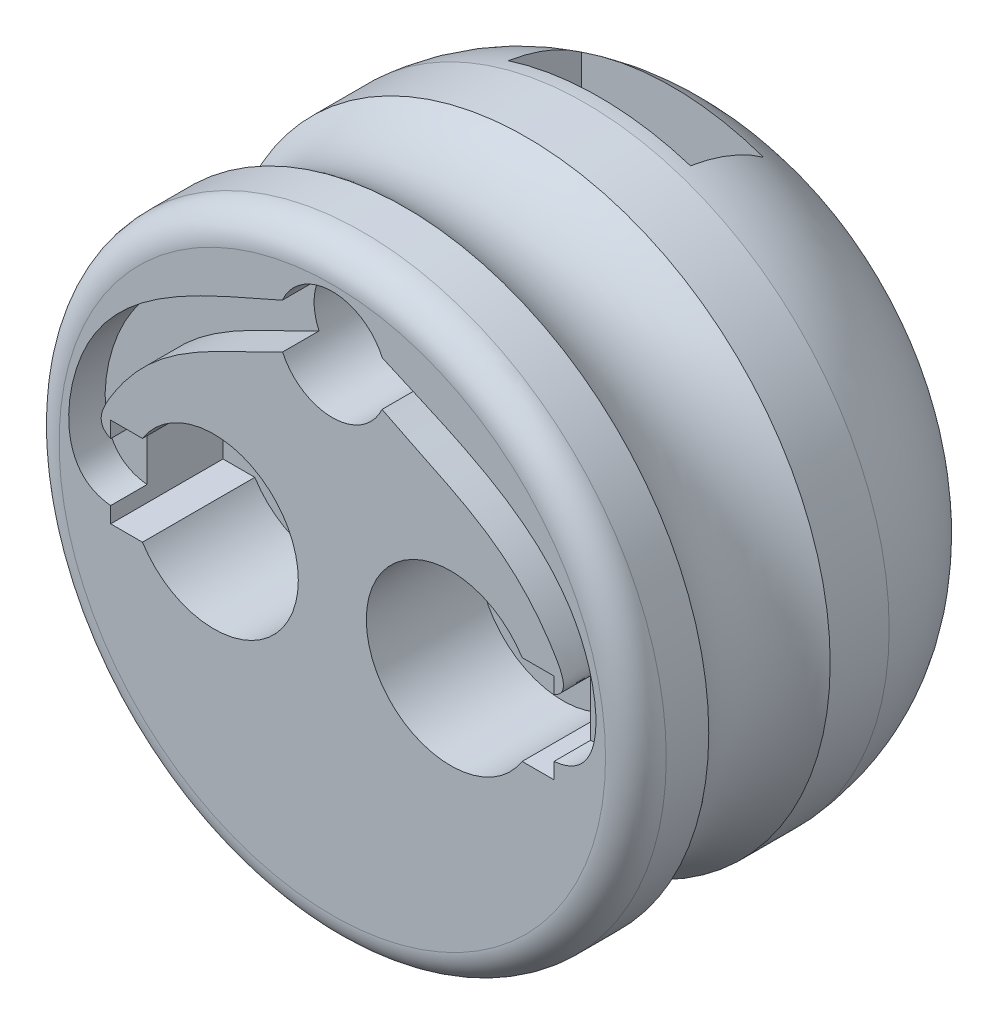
ISO-10303-21;
HEADER;
FILE_DESCRIPTION(('STEP AP214'),'2;1');
FILE_NAME('part.step','',(''),(''),'','','');
FILE_SCHEMA(('AUTOMOTIVE_DESIGN { 1 0 10303 214 1 1 1 1 }'));
ENDSEC;
DATA;
#1=APPLICATION_CONTEXT('core data for automotive mechanical design processes');
#2=APPLICATION_PROTOCOL_DEFINITION('international standard','automotive_design',2000,#1);
#3=PRODUCT_CONTEXT('',#1,'mechanical');
#4=PRODUCT('Part','Part','',(#3));
#5=PRODUCT_RELATED_PRODUCT_CATEGORY('part','',(#4));
#6=PRODUCT_DEFINITION_FORMATION('','',#4);
#7=PRODUCT_DEFINITION_CONTEXT('part definition',#1,'design');
#8=PRODUCT_DEFINITION('design','',#6,#7);
#9=PRODUCT_DEFINITION_SHAPE('','',#8);
#10=(LENGTH_UNIT() NAMED_UNIT(*) SI_UNIT(.MILLI.,.METRE.));
#11=(NAMED_UNIT(*) PLANE_ANGLE_UNIT() SI_UNIT($,.RADIAN.));
#12=(NAMED_UNIT(*) SI_UNIT($,.STERADIAN.) SOLID_ANGLE_UNIT());
#13=UNCERTAINTY_MEASURE_WITH_UNIT(LENGTH_MEASURE(1.E-05),#10,'distance_accuracy_value','');
#14=(GEOMETRIC_REPRESENTATION_CONTEXT(3) GLOBAL_UNCERTAINTY_ASSIGNED_CONTEXT((#13)) GLOBAL_UNIT_ASSIGNED_CONTEXT((#10,
#11,#12)) REPRESENTATION_CONTEXT('',''));
#15=CARTESIAN_POINT('',(0.,0.,0.));
#16=DIRECTION('',(0.,0.,1.));
#17=DIRECTION('',(1.,0.,0.));
#18=AXIS2_PLACEMENT_3D('',#15,#16,#17);
#19=CARTESIAN_POINT('',(0.,25.872394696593,0.));
#20=DIRECTION('',(0.,-1.,0.));
#21=DIRECTION('',(0.,0.,-1.));
#22=AXIS2_PLACEMENT_3D('',#19,#20,#21);
#23=PLANE('',#22);
#24=DIRECTION('',(1.,0.,0.));
#25=VECTOR('',#24,1.);
#26=CARTESIAN_POINT('',(15.,25.872394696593,21.));
#27=LINE('',#26,#25);
#28=CARTESIAN_POINT('',(-15.,25.872394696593,21.));
#29=VERTEX_POINT('',#28);
#30=CARTESIAN_POINT('',(-10.706035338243,25.872394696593,21.));
#31=VERTEX_POINT('',#30);
#32=EDGE_CURVE('E230',#29,#31,#27,.T.);
#33=ORIENTED_EDGE('',*,*,#32,.T.);
#34=DIRECTION('',(0.,0.,-1.));
#35=VECTOR('',#34,1.);
#36=CARTESIAN_POINT('',(-10.706035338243,25.872394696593,42.));
#37=LINE('',#36,#35);
#38=CARTESIAN_POINT('',(-10.706035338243,25.872394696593,9.));
#39=VERTEX_POINT('',#38);
#40=EDGE_CURVE('E571',#31,#39,#37,.T.);
#41=ORIENTED_EDGE('',*,*,#40,.T.);
#42=DIRECTION('',(-1.,0.,0.));
#43=VECTOR('',#42,1.);
#44=CARTESIAN_POINT('',(15.,25.872394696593,8.99999999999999));
#45=LINE('',#44,#43);
#46=CARTESIAN_POINT('',(-15.,25.872394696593,8.99999999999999));
#47=VERTEX_POINT('',#46);
#48=EDGE_CURVE('E219',#39,#47,#45,.T.);
#49=ORIENTED_EDGE('',*,*,#48,.T.);
#50=DIRECTION('',(0.,0.,1.));
#51=VECTOR('',#50,1.);
#52=CARTESIAN_POINT('',(-15.,25.872394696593,8.99999999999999));
#53=LINE('',#52,#51);
#54=EDGE_CURVE('E226',#47,#29,#53,.T.);
#55=ORIENTED_EDGE('',*,*,#54,.T.);
#56=EDGE_LOOP('',(#33,#41,#49,#55));
#57=FACE_BOUND('',#56,.T.);
#58=ADVANCED_FACE('F35',(#57),#23,.F.);
#59=CARTESIAN_POINT('',(-24.0127119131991,23.1615790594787,59.));
#60=DIRECTION('',(0.,0.,1.));
#61=DIRECTION('',(1.,0.,0.));
#62=AXIS2_PLACEMENT_3D('',#59,#60,#61);
#63=PLANE('',#62);
#64=CARTESIAN_POINT('',(0.,35.,59.));
#65=DIRECTION('',(0.,0.,1.));
#66=DIRECTION('',(1.,0.,0.));
#67=AXIS2_PLACEMENT_3D('',#64,#65,#66);
#68=CIRCLE('',#67,9.);
#69=CARTESIAN_POINT('',(-8.23470438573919,38.6317549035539,59.));
#70=VERTEX_POINT('',#69);
#71=CARTESIAN_POINT('',(-8.18910458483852,31.2665610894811,59.));
#72=VERTEX_POINT('',#71);
#73=EDGE_CURVE('E369',#70,#72,#68,.T.);
#74=ORIENTED_EDGE('',*,*,#73,.F.);
#75=CARTESIAN_POINT('',(-1.3419885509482,42.0337612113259,59.));
#76=CARTESIAN_POINT('',(-15.3143615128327,34.2568607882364,59.));
#77=CARTESIAN_POINT('',(-44.4025139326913,28.5990180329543,59.));
#78=CARTESIAN_POINT('',(-44.3308836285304,-4.04239458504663,59.));
#79=CARTESIAN_POINT('',(-36.5,-4.78672823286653,59.));
#80=B_SPLINE_CURVE_WITH_KNOTS('',3,(#75,#76,#77,#78,#79),.UNSPECIFIED.,.F.,.F.,(4,1,4),(0.,
0.72708494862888,1.),.UNSPECIFIED.);
#81=CARTESIAN_POINT('',(-36.5,-4.78672823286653,59.));
#82=VERTEX_POINT('',#81);
#83=EDGE_CURVE('E410',#70,#82,#80,.T.);
#84=ORIENTED_EDGE('',*,*,#83,.T.);
#85=DIRECTION('',(0.,1.,0.));
#86=VECTOR('',#85,1.);
#87=CARTESIAN_POINT('',(-36.5,4.75630146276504,59.));
#88=LINE('',#87,#86);
#89=CARTESIAN_POINT('',(-36.5,4.75630146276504,59.));
#90=VERTEX_POINT('',#89);
#91=EDGE_CURVE('E415',#82,#90,#88,.T.);
#92=ORIENTED_EDGE('',*,*,#91,.T.);
#93=CARTESIAN_POINT('',(-36.5,4.75630146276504,59.));
#94=CARTESIAN_POINT('',(-39.1824470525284,5.89615674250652,59.));
#95=CARTESIAN_POINT('',(-29.7396914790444,24.5928193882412,59.));
#96=CARTESIAN_POINT('',(-16.069951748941,26.0231191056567,59.));
#97=CARTESIAN_POINT('',(-2.08753774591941,34.727379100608,59.));
#98=B_SPLINE_CURVE_WITH_KNOTS('',3,(#93,#94,#95,#96,#97),.UNSPECIFIED.,.F.,.F.,(4,1,4),(0.,
0.137787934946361,1.),.UNSPECIFIED.);
#99=EDGE_CURVE('E265',#90,#72,#98,.T.);
#100=ORIENTED_EDGE('',*,*,#99,.T.);
#101=EDGE_LOOP('',(#74,#84,#92,#100));
#102=FACE_BOUND('',#101,.T.);
#103=ADVANCED_FACE('F404',(#102),#63,.T.);
#104=CARTESIAN_POINT('',(0.,0.,65.));
#105=DIRECTION('',(0.,0.,-1.));
#106=DIRECTION('',(-1.,0.,0.));
#107=AXIS2_PLACEMENT_3D('',#104,#105,#106);
#108=CYLINDRICAL_SURFACE('',#107,50.);
#109=CARTESIAN_POINT('',(0.,0.,33.));
#110=DIRECTION('',(0.,0.,1.));
#111=DIRECTION('',(1.,0.,0.));
#112=AXIS2_PLACEMENT_3D('',#109,#110,#111);
#113=CIRCLE('',#112,50.);
#114=CARTESIAN_POINT('',(50.,0.,33.));
#115=VERTEX_POINT('',#114);
#116=EDGE_CURVE('E492',#115,#115,#113,.T.);
#117=ORIENTED_EDGE('',*,*,#116,.F.);
#118=EDGE_LOOP('',(#117));
#119=FACE_BOUND('',#118,.T.);
#120=CARTESIAN_POINT('',(0.,0.,23.2866542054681));
#121=DIRECTION('',(0.,0.,1.));
#122=DIRECTION('',(1.,0.,0.));
#123=AXIS2_PLACEMENT_3D('',#120,#121,#122);
#124=CIRCLE('',#123,50.);
#125=CARTESIAN_POINT('',(50.,0.,23.2866542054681));
#126=VERTEX_POINT('',#125);
#127=EDGE_CURVE('E352',#126,#126,#124,.T.);
#128=ORIENTED_EDGE('',*,*,#127,.T.);
#129=EDGE_LOOP('',(#128));
#130=FACE_BOUND('',#129,.T.);
#131=ADVANCED_FACE('F340',(#119,#130),#108,.T.);
#132=CARTESIAN_POINT('',(0.,-35.7882564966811,0.));
#133=CARTESIAN_POINT('',(0.,-48.6758327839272,8.17835868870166));
#134=CARTESIAN_POINT('',(0.,-50.,23.2866542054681));
#135=B_SPLINE_CURVE_WITH_KNOTS('',2,(#132,#133,#134),.UNSPECIFIED.,.F.,.F.,(3,3),(0.,1.),.UNSPECIFIED.);
#136=CARTESIAN_POINT('',(0.,0.,65.));
#137=DIRECTION('',(0.,0.,1.));
#138=AXIS1_PLACEMENT('',#136,#137);
#139=SURFACE_OF_REVOLUTION('',#135,#138);
#140=CARTESIAN_POINT('',(0.,0.,8.99999999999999));
#141=DIRECTION('',(0.,0.,1.));
#142=DIRECTION('',(1.,0.,0.));
#143=AXIS2_PLACEMENT_3D('',#140,#141,#142);
#144=CIRCLE('',#143,45.2043558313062);
#145=CARTESIAN_POINT('',(-15.,42.6430977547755,8.99999999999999));
#146=VERTEX_POINT('',#145);
#147=CARTESIAN_POINT('',(15.,42.6430977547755,8.99999999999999));
#148=VERTEX_POINT('',#147);
#149=EDGE_CURVE('E236',#146,#148,#144,.F.);
#150=ORIENTED_EDGE('',*,*,#149,.T.);
#151=CARTESIAN_POINT('',(15.,42.6430977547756,9.00000000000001));
#152=CARTESIAN_POINT('',(15.,42.7988184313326,9.22080204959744));
#153=CARTESIAN_POINT('',(15.,42.9512231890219,9.44392347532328));
#154=CARTESIAN_POINT('',(15.,43.2492571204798,9.89464655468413));
#155=CARTESIAN_POINT('',(15.,43.3948862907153,10.1222482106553));
#156=CARTESIAN_POINT('',(15.,43.8212491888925,10.8113004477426));
#157=CARTESIAN_POINT('',(15.,44.0916178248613,11.2792244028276));
#158=CARTESIAN_POINT('',(15.,44.6036584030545,12.230418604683));
#159=CARTESIAN_POINT('',(15.,44.8453329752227,12.7136874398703));
#160=CARTESIAN_POINT('',(15.,45.2953929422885,13.6847733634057));
#161=CARTESIAN_POINT('',(15.,45.5043058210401,14.1723460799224));
#162=CARTESIAN_POINT('',(15.,45.8939603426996,15.1585552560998));
#163=CARTESIAN_POINT('',(15.,46.0747040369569,15.6571909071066));
#164=CARTESIAN_POINT('',(15.,46.408288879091,16.6634927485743));
#165=CARTESIAN_POINT('',(15.,46.5611412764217,17.1711552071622));
#166=CARTESIAN_POINT('',(15.,46.774489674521,17.9545247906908));
#167=CARTESIAN_POINT('',(15.,46.8447350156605,18.2276202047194));
#168=CARTESIAN_POINT('',(15.,46.9776521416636,18.7755892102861));
#169=CARTESIAN_POINT('',(15.,47.0403256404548,19.0504623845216));
#170=CARTESIAN_POINT('',(15.,47.1586531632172,19.6036336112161));
#171=CARTESIAN_POINT('',(15.,47.2142574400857,19.8819422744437));
#172=CARTESIAN_POINT('',(15.,47.3181302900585,20.439978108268));
#173=CARTESIAN_POINT('',(15.,47.3663975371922,20.7197055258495));
#174=CARTESIAN_POINT('',(15.,47.4110750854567,21.));
#175=B_SPLINE_CURVE_WITH_KNOTS('',3,(#151,#152,#153,#154,#155,#156,#157,#158,#159,#160,#161,
#162,#163,#164,#165,#166,#167,#168,#169,#170,#171,#172,#173,#174),.UNSPECIFIED.,.F.,.F.,(4,2,2,
2,2,2,2,2,2,2,2,4),(0.,0.810506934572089,1.62101429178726,3.24120023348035,4.86123756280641,
6.45167947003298,8.0420055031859,9.63168868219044,10.4775534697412,11.3232264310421,
12.1745549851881,13.0260372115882),.UNSPECIFIED.);
#176=CARTESIAN_POINT('',(15.,47.4110750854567,21.));
#177=VERTEX_POINT('',#176);
#178=EDGE_CURVE('E377',#148,#177,#175,.T.);
#179=ORIENTED_EDGE('',*,*,#178,.T.);
#180=CARTESIAN_POINT('',(0.,0.,21.));
#181=DIRECTION('',(0.,0.,1.));
#182=DIRECTION('',(1.,0.,0.));
#183=AXIS2_PLACEMENT_3D('',#180,#181,#182);
#184=CIRCLE('',#183,49.727357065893);
#185=CARTESIAN_POINT('',(-15.,47.4110750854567,21.));
#186=VERTEX_POINT('',#185);
#187=EDGE_CURVE('E246',#177,#186,#184,.T.);
#188=ORIENTED_EDGE('',*,*,#187,.T.);
#189=CARTESIAN_POINT('',(-15.,47.4110750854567,21.));
#190=CARTESIAN_POINT('',(-15.,47.3261223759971,20.4668540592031));
#191=CARTESIAN_POINT('',(-15.,47.228125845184,19.9357090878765));
#192=CARTESIAN_POINT('',(-15.,47.0048575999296,18.8783951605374));
#193=CARTESIAN_POINT('',(-15.,46.8795467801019,18.3522344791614));
#194=CARTESIAN_POINT('',(-15.,46.6006368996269,17.3071686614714));
#195=CARTESIAN_POINT('',(-15.,46.447024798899,16.788266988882));
#196=CARTESIAN_POINT('',(-15.,46.114190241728,15.7701039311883));
#197=CARTESIAN_POINT('',(-15.,45.9355359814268,15.270657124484));
#198=CARTESIAN_POINT('',(-15.,45.550192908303,14.2830074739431));
#199=CARTESIAN_POINT('',(-15.,45.3435196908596,13.7947985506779));
#200=CARTESIAN_POINT('',(-15.,44.9022158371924,12.8315048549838));
#201=CARTESIAN_POINT('',(-15.,44.6676027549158,12.356412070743));
#202=CARTESIAN_POINT('',(-15.,44.2870516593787,11.6398214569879));
#203=CARTESIAN_POINT('',(-15.,44.1509843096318,11.3930332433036));
#204=CARTESIAN_POINT('',(-15.,43.8711666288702,10.9038800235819));
#205=CARTESIAN_POINT('',(-15.,43.7274172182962,10.6615144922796));
#206=CARTESIAN_POINT('',(-15.,43.4313105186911,10.1797142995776));
#207=CARTESIAN_POINT('',(-15.,43.2788990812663,9.94031293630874));
#208=CARTESIAN_POINT('',(-15.,42.9665757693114,9.46641530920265));
#209=CARTESIAN_POINT('',(-15.,42.8066630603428,9.23191959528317));
#210=CARTESIAN_POINT('',(-15.,42.6430977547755,8.99999999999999));
#211=B_SPLINE_CURVE_WITH_KNOTS('',3,(#189,#190,#191,#192,#193,#194,#195,#196,#197,#198,#199,
#200,#201,#202,#203,#204,#205,#206,#207,#208,#209,#210),.UNSPECIFIED.,.F.,.F.,(4,2,2,2,2,2,2,2,
2,2,4),(0.,1.61956855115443,3.24147122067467,4.86412307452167,6.45460091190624,8.04419709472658,
9.63279978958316,10.4781221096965,11.3233433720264,12.1746016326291,13.0259548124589),.UNSPECIFIED.);
#212=EDGE_CURVE('E370',#186,#146,#211,.T.);
#213=ORIENTED_EDGE('',*,*,#212,.T.);
#214=EDGE_LOOP('',(#150,#179,#188,#213));
#215=FACE_BOUND('',#214,.T.);
#216=ORIENTED_EDGE('',*,*,#127,.F.);
#217=EDGE_LOOP('',(#216));
#218=FACE_BOUND('',#217,.T.);
#219=CARTESIAN_POINT('',(0.,0.,0.));
#220=DIRECTION('',(0.,0.,1.));
#221=DIRECTION('',(1.,0.,0.));
#222=AXIS2_PLACEMENT_3D('',#219,#220,#221);
#223=CIRCLE('',#222,35.7882564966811);
#224=CARTESIAN_POINT('',(35.7882564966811,0.,0.));
#225=VERTEX_POINT('',#224);
#226=EDGE_CURVE('E358',#225,#225,#223,.T.);
#227=ORIENTED_EDGE('',*,*,#226,.T.);
#228=EDGE_LOOP('',(#227));
#229=FACE_BOUND('',#228,.T.);
#230=ADVANCED_FACE('F335',(#215,#218,#229),#139,.T.);
#231=CARTESIAN_POINT('',(0.,0.,0.));
#232=DIRECTION('',(0.,0.,1.));
#233=DIRECTION('',(1.,0.,0.));
#234=AXIS2_PLACEMENT_3D('',#231,#232,#233);
#235=PLANE('',#234);
#236=CARTESIAN_POINT('',(0.,0.,0.));
#237=DIRECTION('',(0.,0.,-1.));
#238=DIRECTION('',(-1.,0.,0.));
#239=AXIS2_PLACEMENT_3D('',#236,#237,#238);
#240=CIRCLE('',#239,28.);
#241=CARTESIAN_POINT('',(-28.,0.,0.));
#242=VERTEX_POINT('',#241);
#243=EDGE_CURVE('E210',#242,#242,#240,.T.);
#244=ORIENTED_EDGE('',*,*,#243,.F.);
#245=EDGE_LOOP('',(#244));
#246=FACE_BOUND('',#245,.T.);
#247=ORIENTED_EDGE('',*,*,#226,.F.);
#248=EDGE_LOOP('',(#247));
#249=FACE_BOUND('',#248,.T.);
#250=ADVANCED_FACE('F333',(#246,#249),#235,.F.);
#251=CARTESIAN_POINT('',(0.,0.,43.));
#252=DIRECTION('',(0.,0.,1.));
#253=DIRECTION('',(1.,0.,0.));
#254=AXIS2_PLACEMENT_3D('',#251,#252,#253);
#255=TOROIDAL_SURFACE('',#254,62.4899852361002,15.9999915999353);
#256=CARTESIAN_POINT('',(0.,0.,53.));
#257=DIRECTION('',(0.,0.,1.));
#258=DIRECTION('',(1.,0.,0.));
#259=AXIS2_PLACEMENT_3D('',#256,#257,#258);
#260=CIRCLE('',#259,50.);
#261=CARTESIAN_POINT('',(50.,0.,53.));
#262=VERTEX_POINT('',#261);
#263=EDGE_CURVE('E350',#262,#262,#260,.T.);
#264=ORIENTED_EDGE('',*,*,#263,.F.);
#265=EDGE_LOOP('',(#264));
#266=FACE_BOUND('',#265,.T.);
#267=ORIENTED_EDGE('',*,*,#116,.T.);
#268=EDGE_LOOP('',(#267));
#269=FACE_BOUND('',#268,.T.);
#270=ADVANCED_FACE('F329',(#266,#269),#255,.F.);
#271=CARTESIAN_POINT('',(0.,0.,65.));
#272=DIRECTION('',(0.,0.,1.));
#273=DIRECTION('',(1.,0.,0.));
#274=AXIS2_PLACEMENT_3D('',#271,#272,#273);
#275=PLANE('',#274);
#276=CARTESIAN_POINT('',(0.,35.,65.));
#277=DIRECTION('',(0.,0.,1.));
#278=DIRECTION('',(1.,0.,0.));
#279=AXIS2_PLACEMENT_3D('',#276,#277,#278);
#280=CIRCLE('',#279,9.);
#281=CARTESIAN_POINT('',(8.23470438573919,38.6317549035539,65.));
#282=VERTEX_POINT('',#281);
#283=CARTESIAN_POINT('',(-8.23470438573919,38.6317549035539,65.));
#284=VERTEX_POINT('',#283);
#285=EDGE_CURVE('E250',#282,#284,#280,.T.);
#286=ORIENTED_EDGE('',*,*,#285,.F.);
#287=CARTESIAN_POINT('',(36.5,-4.78672823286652,65.));
#288=CARTESIAN_POINT('',(44.3308836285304,-4.04239458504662,65.));
#289=CARTESIAN_POINT('',(44.4025139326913,28.5990180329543,65.));
#290=CARTESIAN_POINT('',(15.3143615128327,34.2568607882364,65.));
#291=CARTESIAN_POINT('',(1.34198855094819,42.0337612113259,65.));
#292=B_SPLINE_CURVE_WITH_KNOTS('',3,(#287,#288,#289,#290,#291),.UNSPECIFIED.,.F.,.F.,(4,1,4),
(0.,0.27291505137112,1.),.UNSPECIFIED.);
#293=CARTESIAN_POINT('',(36.5,-4.78672823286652,65.));
#294=VERTEX_POINT('',#293);
#295=EDGE_CURVE('E437',#294,#282,#292,.T.);
#296=ORIENTED_EDGE('',*,*,#295,.F.);
#297=DIRECTION('',(0.,1.,0.));
#298=VECTOR('',#297,1.);
#299=CARTESIAN_POINT('',(36.5,7.4,65.));
#300=LINE('',#299,#298);
#301=CARTESIAN_POINT('',(36.5,-7.4,65.));
#302=VERTEX_POINT('',#301);
#303=EDGE_CURVE('E485',#302,#294,#300,.T.);
#304=ORIENTED_EDGE('',*,*,#303,.F.);
#305=DIRECTION('',(1.,0.,0.));
#306=VECTOR('',#305,1.);
#307=CARTESIAN_POINT('',(36.5,-7.4,65.));
#308=LINE('',#307,#306);
#309=CARTESIAN_POINT('',(31.2664778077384,-7.4,65.));
#310=VERTEX_POINT('',#309);
#311=EDGE_CURVE('E480',#310,#302,#308,.T.);
#312=ORIENTED_EDGE('',*,*,#311,.F.);
#313=CARTESIAN_POINT('',(19.5,0.,65.));
#314=DIRECTION('',(0.,0.,1.));
#315=DIRECTION('',(1.,0.,0.));
#316=AXIS2_PLACEMENT_3D('',#313,#314,#315);
#317=CIRCLE('',#316,13.9);
#318=CARTESIAN_POINT('',(31.2664778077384,7.4,65.));
#319=VERTEX_POINT('',#318);
#320=EDGE_CURVE('E478',#319,#310,#317,.T.);
#321=ORIENTED_EDGE('',*,*,#320,.F.);
#322=DIRECTION('',(-1.,0.,0.));
#323=VECTOR('',#322,1.);
#324=CARTESIAN_POINT('',(36.5,7.4,65.));
#325=LINE('',#324,#323);
#326=CARTESIAN_POINT('',(36.5,7.4,65.));
#327=VERTEX_POINT('',#326);
#328=EDGE_CURVE('E468',#327,#319,#325,.T.);
#329=ORIENTED_EDGE('',*,*,#328,.F.);
#330=CARTESIAN_POINT('',(36.5,4.75630146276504,65.));
#331=VERTEX_POINT('',#330);
#332=EDGE_CURVE('E484',#331,#327,#300,.T.);
#333=ORIENTED_EDGE('',*,*,#332,.F.);
#334=CARTESIAN_POINT('',(2.0875377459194,34.727379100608,65.));
#335=CARTESIAN_POINT('',(16.0699517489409,26.0231191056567,65.));
#336=CARTESIAN_POINT('',(29.7396914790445,24.5928193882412,65.));
#337=CARTESIAN_POINT('',(39.1824470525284,5.89615674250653,65.));
#338=CARTESIAN_POINT('',(36.5,4.75630146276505,65.));
#339=B_SPLINE_CURVE_WITH_KNOTS('',3,(#334,#335,#336,#337,#338),.UNSPECIFIED.,.F.,.F.,(4,1,4),
(0.,0.862212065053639,1.),.UNSPECIFIED.);
#340=CARTESIAN_POINT('',(8.18910458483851,31.2665610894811,65.));
#341=VERTEX_POINT('',#340);
#342=EDGE_CURVE('E430',#341,#331,#339,.T.);
#343=ORIENTED_EDGE('',*,*,#342,.F.);
#344=CARTESIAN_POINT('',(-8.18910458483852,31.2665610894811,65.));
#345=VERTEX_POINT('',#344);
#346=EDGE_CURVE('E249',#345,#341,#280,.T.);
#347=ORIENTED_EDGE('',*,*,#346,.F.);
#348=CARTESIAN_POINT('',(-36.5,4.75630146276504,65.));
#349=CARTESIAN_POINT('',(-39.1824470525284,5.89615674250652,65.));
#350=CARTESIAN_POINT('',(-29.7396914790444,24.5928193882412,65.));
#351=CARTESIAN_POINT('',(-16.069951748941,26.0231191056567,65.));
#352=CARTESIAN_POINT('',(-2.08753774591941,34.727379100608,65.));
#353=B_SPLINE_CURVE_WITH_KNOTS('',3,(#348,#349,#350,#351,#352),.UNSPECIFIED.,.F.,.F.,(4,1,4),
(0.,0.137787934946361,1.),.UNSPECIFIED.);
#354=CARTESIAN_POINT('',(-36.5,4.75630146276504,65.));
#355=VERTEX_POINT('',#354);
#356=EDGE_CURVE('E264',#355,#345,#353,.T.);
#357=ORIENTED_EDGE('',*,*,#356,.F.);
#358=DIRECTION('',(0.,-1.,0.));
#359=VECTOR('',#358,1.);
#360=CARTESIAN_POINT('',(-36.5,7.4,65.));
#361=LINE('',#360,#359);
#362=CARTESIAN_POINT('',(-36.5,7.4,65.));
#363=VERTEX_POINT('',#362);
#364=EDGE_CURVE('E514',#363,#355,#361,.T.);
#365=ORIENTED_EDGE('',*,*,#364,.F.);
#366=DIRECTION('',(-1.,0.,0.));
#367=VECTOR('',#366,1.);
#368=CARTESIAN_POINT('',(-36.5,7.4,65.));
#369=LINE('',#368,#367);
#370=CARTESIAN_POINT('',(-31.2664778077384,7.4,65.));
#371=VERTEX_POINT('',#370);
#372=EDGE_CURVE('E504',#371,#363,#369,.T.);
#373=ORIENTED_EDGE('',*,*,#372,.F.);
#374=CARTESIAN_POINT('',(-19.5,0.,65.));
#375=DIRECTION('',(0.,0.,1.));
#376=DIRECTION('',(1.,0.,0.));
#377=AXIS2_PLACEMENT_3D('',#374,#375,#376);
#378=CIRCLE('',#377,13.9);
#379=CARTESIAN_POINT('',(-31.2664778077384,-7.4,65.));
#380=VERTEX_POINT('',#379);
#381=EDGE_CURVE('E520',#380,#371,#378,.T.);
#382=ORIENTED_EDGE('',*,*,#381,.F.);
#383=DIRECTION('',(1.,0.,0.));
#384=VECTOR('',#383,1.);
#385=CARTESIAN_POINT('',(-36.5,-7.4,65.));
#386=LINE('',#385,#384);
#387=CARTESIAN_POINT('',(-36.5,-7.4,65.));
#388=VERTEX_POINT('',#387);
#389=EDGE_CURVE('E517',#388,#380,#386,.T.);
#390=ORIENTED_EDGE('',*,*,#389,.F.);
#391=CARTESIAN_POINT('',(-36.5,-4.78672823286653,65.));
#392=VERTEX_POINT('',#391);
#393=EDGE_CURVE('E456',#392,#388,#361,.T.);
#394=ORIENTED_EDGE('',*,*,#393,.F.);
#395=CARTESIAN_POINT('',(-1.3419885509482,42.0337612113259,65.));
#396=CARTESIAN_POINT('',(-15.3143615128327,34.2568607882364,65.));
#397=CARTESIAN_POINT('',(-44.4025139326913,28.5990180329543,65.));
#398=CARTESIAN_POINT('',(-44.3308836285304,-4.04239458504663,65.));
#399=CARTESIAN_POINT('',(-36.5,-4.78672823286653,65.));
#400=B_SPLINE_CURVE_WITH_KNOTS('',3,(#395,#396,#397,#398,#399),.UNSPECIFIED.,.F.,.F.,(4,1,4),
(0.,0.72708494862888,1.),.UNSPECIFIED.);
#401=EDGE_CURVE('E272',#284,#392,#400,.T.);
#402=ORIENTED_EDGE('',*,*,#401,.F.);
#403=EDGE_LOOP('',(#286,#296,#304,#312,#321,#329,#333,#343,#347,#357,#365,#373,#382,#390,#394,#402));
#404=FACE_BOUND('',#403,.T.);
#405=CARTESIAN_POINT('',(0.,0.,65.));
#406=DIRECTION('',(0.,0.,1.));
#407=DIRECTION('',(1.,0.,0.));
#408=AXIS2_PLACEMENT_3D('',#405,#406,#407);
#409=CIRCLE('',#408,45.);
#410=CARTESIAN_POINT('',(45.,0.,65.));
#411=VERTEX_POINT('',#410);
#412=EDGE_CURVE('E361',#411,#411,#409,.T.);
#413=ORIENTED_EDGE('',*,*,#412,.T.);
#414=EDGE_LOOP('',(#413));
#415=FACE_BOUND('',#414,.T.);
#416=ADVANCED_FACE('F332',(#404,#415),#275,.T.);
#417=CARTESIAN_POINT('',(0.,0.,60.));
#418=DIRECTION('',(0.,0.,1.));
#419=DIRECTION('',(1.,0.,0.));
#420=AXIS2_PLACEMENT_3D('',#417,#418,#419);
#421=CIRCLE('',#420,50.);
#422=CARTESIAN_POINT('',(50.,0.,60.));
#423=VERTEX_POINT('',#422);
#424=EDGE_CURVE('E364',#423,#423,#421,.F.);
#425=ORIENTED_EDGE('',*,*,#424,.T.);
#426=EDGE_LOOP('',(#425));
#427=FACE_BOUND('',#426,.T.);
#428=ORIENTED_EDGE('',*,*,#263,.T.);
#429=EDGE_LOOP('',(#428));
#430=FACE_BOUND('',#429,.T.);
#431=ADVANCED_FACE('F537',(#427,#430),#108,.T.);
#432=CARTESIAN_POINT('',(0.,0.,60.));
#433=DIRECTION('',(0.,0.,1.));
#434=DIRECTION('',(1.,0.,0.));
#435=AXIS2_PLACEMENT_3D('',#432,#433,#434);
#436=TOROIDAL_SURFACE('',#435,45.,5.);
#437=ORIENTED_EDGE('',*,*,#424,.F.);
#438=EDGE_LOOP('',(#437));
#439=FACE_BOUND('',#438,.T.);
#440=ORIENTED_EDGE('',*,*,#412,.F.);
#441=EDGE_LOOP('',(#440));
#442=FACE_BOUND('',#441,.T.);
#443=ADVANCED_FACE('F37',(#439,#442),#436,.T.);
#444=CARTESIAN_POINT('',(-36.5,7.4,46.5));
#445=DIRECTION('',(-1.,0.,0.));
#446=DIRECTION('',(0.,0.,1.));
#447=AXIS2_PLACEMENT_3D('',#444,#445,#446);
#448=PLANE('',#447);
#449=ORIENTED_EDGE('',*,*,#364,.T.);
#450=DIRECTION('',(0.,0.,1.));
#451=VECTOR('',#450,1.);
#452=CARTESIAN_POINT('',(-36.5,4.75630146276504,59.));
#453=LINE('',#452,#451);
#454=EDGE_CURVE('E451',#90,#355,#453,.T.);
#455=ORIENTED_EDGE('',*,*,#454,.F.);
#456=ORIENTED_EDGE('',*,*,#91,.F.);
#457=DIRECTION('',(0.,0.,1.));
#458=VECTOR('',#457,1.);
#459=CARTESIAN_POINT('',(-36.5,-4.78672823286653,59.));
#460=LINE('',#459,#458);
#461=EDGE_CURVE('E457',#82,#392,#460,.T.);
#462=ORIENTED_EDGE('',*,*,#461,.T.);
#463=ORIENTED_EDGE('',*,*,#393,.T.);
#464=DIRECTION('',(0.,0.,1.));
#465=VECTOR('',#464,1.);
#466=CARTESIAN_POINT('',(-36.5,-7.4,46.5));
#467=LINE('',#466,#465);
#468=CARTESIAN_POINT('',(-36.5,-7.4,46.5));
#469=VERTEX_POINT('',#468);
#470=EDGE_CURVE('E513',#469,#388,#467,.T.);
#471=ORIENTED_EDGE('',*,*,#470,.F.);
#472=DIRECTION('',(0.,-1.,0.));
#473=VECTOR('',#472,1.);
#474=CARTESIAN_POINT('',(-36.5,7.4,46.5));
#475=LINE('',#474,#473);
#476=CARTESIAN_POINT('',(-36.5,7.4,46.5));
#477=VERTEX_POINT('',#476);
#478=EDGE_CURVE('E500',#477,#469,#475,.T.);
#479=ORIENTED_EDGE('',*,*,#478,.F.);
#480=DIRECTION('',(0.,0.,1.));
#481=VECTOR('',#480,1.);
#482=CARTESIAN_POINT('',(-36.5,7.4,46.5));
#483=LINE('',#482,#481);
#484=EDGE_CURVE('E481',#477,#363,#483,.T.);
#485=ORIENTED_EDGE('',*,*,#484,.T.);
#486=EDGE_LOOP('',(#449,#455,#456,#462,#463,#471,#479,#485));
#487=FACE_BOUND('',#486,.T.);
#488=ADVANCED_FACE('F318',(#487),#448,.F.);
#489=CARTESIAN_POINT('',(-36.5,7.4,46.5));
#490=DIRECTION('',(0.,1.,0.));
#491=DIRECTION('',(0.,0.,1.));
#492=AXIS2_PLACEMENT_3D('',#489,#490,#491);
#493=PLANE('',#492);
#494=ORIENTED_EDGE('',*,*,#372,.T.);
#495=ORIENTED_EDGE('',*,*,#484,.F.);
#496=DIRECTION('',(-1.,0.,0.));
#497=VECTOR('',#496,1.);
#498=CARTESIAN_POINT('',(-36.5,7.4,46.5));
#499=LINE('',#498,#497);
#500=CARTESIAN_POINT('',(-31.2664778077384,7.4,46.5));
#501=VERTEX_POINT('',#500);
#502=EDGE_CURVE('E510',#501,#477,#499,.T.);
#503=ORIENTED_EDGE('',*,*,#502,.F.);
#504=DIRECTION('',(0.,0.,1.));
#505=VECTOR('',#504,1.);
#506=CARTESIAN_POINT('',(-31.2664778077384,7.4,46.5));
#507=LINE('',#506,#505);
#508=EDGE_CURVE('E526',#501,#371,#507,.T.);
#509=ORIENTED_EDGE('',*,*,#508,.T.);
#510=EDGE_LOOP('',(#494,#495,#503,#509));
#511=FACE_BOUND('',#510,.T.);
#512=ADVANCED_FACE('F314',(#511),#493,.F.);
#513=CARTESIAN_POINT('',(-19.5,0.,46.5));
#514=DIRECTION('',(0.,0.,1.));
#515=DIRECTION('',(1.,0.,0.));
#516=AXIS2_PLACEMENT_3D('',#513,#514,#515);
#517=CYLINDRICAL_SURFACE('',#516,13.9);
#518=ORIENTED_EDGE('',*,*,#381,.T.);
#519=ORIENTED_EDGE('',*,*,#508,.F.);
#520=CARTESIAN_POINT('',(-19.5,0.,46.5));
#521=DIRECTION('',(0.,0.,1.));
#522=DIRECTION('',(1.,0.,0.));
#523=AXIS2_PLACEMENT_3D('',#520,#521,#522);
#524=CIRCLE('',#523,13.9);
#525=CARTESIAN_POINT('',(-31.2664778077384,-7.4,46.5));
#526=VERTEX_POINT('',#525);
#527=EDGE_CURVE('E507',#526,#501,#524,.T.);
#528=ORIENTED_EDGE('',*,*,#527,.F.);
#529=DIRECTION('',(0.,0.,1.));
#530=VECTOR('',#529,1.);
#531=CARTESIAN_POINT('',(-31.2664778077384,-7.4,46.5));
#532=LINE('',#531,#530);
#533=EDGE_CURVE('E528',#526,#380,#532,.T.);
#534=ORIENTED_EDGE('',*,*,#533,.T.);
#535=EDGE_LOOP('',(#518,#519,#528,#534));
#536=FACE_BOUND('',#535,.T.);
#537=ADVANCED_FACE('F317',(#536),#517,.F.);
#538=CARTESIAN_POINT('',(-36.5,-7.4,46.5));
#539=DIRECTION('',(0.,-1.,0.));
#540=DIRECTION('',(0.,0.,-1.));
#541=AXIS2_PLACEMENT_3D('',#538,#539,#540);
#542=PLANE('',#541);
#543=ORIENTED_EDGE('',*,*,#389,.T.);
#544=ORIENTED_EDGE('',*,*,#533,.F.);
#545=DIRECTION('',(1.,0.,0.));
#546=VECTOR('',#545,1.);
#547=CARTESIAN_POINT('',(-36.5,-7.4,46.5));
#548=LINE('',#547,#546);
#549=EDGE_CURVE('E503',#469,#526,#548,.T.);
#550=ORIENTED_EDGE('',*,*,#549,.F.);
#551=ORIENTED_EDGE('',*,*,#470,.T.);
#552=EDGE_LOOP('',(#543,#544,#550,#551));
#553=FACE_BOUND('',#552,.T.);
#554=ADVANCED_FACE('F312',(#553),#542,.F.);
#555=CARTESIAN_POINT('',(-19.5,0.,46.5));
#556=DIRECTION('',(0.,0.,1.));
#557=DIRECTION('',(1.,0.,0.));
#558=AXIS2_PLACEMENT_3D('',#555,#556,#557);
#559=PLANE('',#558);
#560=ORIENTED_EDGE('',*,*,#478,.T.);
#561=ORIENTED_EDGE('',*,*,#549,.T.);
#562=ORIENTED_EDGE('',*,*,#527,.T.);
#563=ORIENTED_EDGE('',*,*,#502,.T.);
#564=EDGE_LOOP('',(#560,#561,#562,#563));
#565=FACE_BOUND('',#564,.T.);
#566=ADVANCED_FACE('F308',(#565),#559,.T.);
#567=CARTESIAN_POINT('',(19.5,0.,46.5));
#568=DIRECTION('',(0.,0.,1.));
#569=DIRECTION('',(1.,0.,0.));
#570=AXIS2_PLACEMENT_3D('',#567,#568,#569);
#571=CYLINDRICAL_SURFACE('',#570,13.9);
#572=ORIENTED_EDGE('',*,*,#320,.T.);
#573=DIRECTION('',(0.,0.,1.));
#574=VECTOR('',#573,1.);
#575=CARTESIAN_POINT('',(31.2664778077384,-7.4,46.5));
#576=LINE('',#575,#574);
#577=CARTESIAN_POINT('',(31.2664778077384,-7.4,46.5));
#578=VERTEX_POINT('',#577);
#579=EDGE_CURVE('E477',#578,#310,#576,.T.);
#580=ORIENTED_EDGE('',*,*,#579,.F.);
#581=CARTESIAN_POINT('',(19.5,0.,46.5));
#582=DIRECTION('',(0.,0.,1.));
#583=DIRECTION('',(1.,0.,0.));
#584=AXIS2_PLACEMENT_3D('',#581,#582,#583);
#585=CIRCLE('',#584,13.9);
#586=CARTESIAN_POINT('',(31.2664778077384,7.4,46.5));
#587=VERTEX_POINT('',#586);
#588=EDGE_CURVE('E464',#587,#578,#585,.T.);
#589=ORIENTED_EDGE('',*,*,#588,.F.);
#590=DIRECTION('',(0.,0.,1.));
#591=VECTOR('',#590,1.);
#592=CARTESIAN_POINT('',(31.2664778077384,7.4,46.5));
#593=LINE('',#592,#591);
#594=EDGE_CURVE('E490',#587,#319,#593,.T.);
#595=ORIENTED_EDGE('',*,*,#594,.T.);
#596=EDGE_LOOP('',(#572,#580,#589,#595));
#597=FACE_BOUND('',#596,.T.);
#598=ADVANCED_FACE('F298',(#597),#571,.F.);
#599=CARTESIAN_POINT('',(36.5,7.4,46.5));
#600=DIRECTION('',(0.,1.,0.));
#601=DIRECTION('',(-1.,0.,0.));
#602=AXIS2_PLACEMENT_3D('',#599,#600,#601);
#603=PLANE('',#602);
#604=ORIENTED_EDGE('',*,*,#328,.T.);
#605=ORIENTED_EDGE('',*,*,#594,.F.);
#606=DIRECTION('',(-1.,0.,0.));
#607=VECTOR('',#606,1.);
#608=CARTESIAN_POINT('',(36.5,7.4,46.5));
#609=LINE('',#608,#607);
#610=CARTESIAN_POINT('',(36.5,7.4,46.5));
#611=VERTEX_POINT('',#610);
#612=EDGE_CURVE('E474',#611,#587,#609,.T.);
#613=ORIENTED_EDGE('',*,*,#612,.F.);
#614=DIRECTION('',(0.,0.,1.));
#615=VECTOR('',#614,1.);
#616=CARTESIAN_POINT('',(36.5,7.4,46.5));
#617=LINE('',#616,#615);
#618=EDGE_CURVE('E493',#611,#327,#617,.T.);
#619=ORIENTED_EDGE('',*,*,#618,.T.);
#620=EDGE_LOOP('',(#604,#605,#613,#619));
#621=FACE_BOUND('',#620,.T.);
#622=ADVANCED_FACE('F294',(#621),#603,.F.);
#623=CARTESIAN_POINT('',(36.5,7.4,46.5));
#624=DIRECTION('',(1.,0.,0.));
#625=DIRECTION('',(0.,0.,-1.));
#626=AXIS2_PLACEMENT_3D('',#623,#624,#625);
#627=PLANE('',#626);
#628=ORIENTED_EDGE('',*,*,#303,.T.);
#629=DIRECTION('',(0.,0.,1.));
#630=VECTOR('',#629,1.);
#631=CARTESIAN_POINT('',(36.5,-4.78672823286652,59.));
#632=LINE('',#631,#630);
#633=CARTESIAN_POINT('',(36.5,-4.78672823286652,59.));
#634=VERTEX_POINT('',#633);
#635=EDGE_CURVE('E460',#634,#294,#632,.T.);
#636=ORIENTED_EDGE('',*,*,#635,.F.);
#637=DIRECTION('',(0.,-1.,0.));
#638=VECTOR('',#637,1.);
#639=CARTESIAN_POINT('',(36.5,4.75630146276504,59.));
#640=LINE('',#639,#638);
#641=CARTESIAN_POINT('',(36.5,4.75630146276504,59.));
#642=VERTEX_POINT('',#641);
#643=EDGE_CURVE('E796',#642,#634,#640,.T.);
#644=ORIENTED_EDGE('',*,*,#643,.F.);
#645=DIRECTION('',(0.,0.,1.));
#646=VECTOR('',#645,1.);
#647=CARTESIAN_POINT('',(36.5,4.75630146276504,59.));
#648=LINE('',#647,#646);
#649=EDGE_CURVE('E425',#642,#331,#648,.T.);
#650=ORIENTED_EDGE('',*,*,#649,.T.);
#651=ORIENTED_EDGE('',*,*,#332,.T.);
#652=ORIENTED_EDGE('',*,*,#618,.F.);
#653=DIRECTION('',(0.,1.,0.));
#654=VECTOR('',#653,1.);
#655=CARTESIAN_POINT('',(36.5,7.4,46.5));
#656=LINE('',#655,#654);
#657=CARTESIAN_POINT('',(36.5,-7.4,46.5));
#658=VERTEX_POINT('',#657);
#659=EDGE_CURVE('E471',#658,#611,#656,.T.);
#660=ORIENTED_EDGE('',*,*,#659,.F.);
#661=DIRECTION('',(0.,0.,1.));
#662=VECTOR('',#661,1.);
#663=CARTESIAN_POINT('',(36.5,-7.4,46.5));
#664=LINE('',#663,#662);
#665=EDGE_CURVE('E496',#658,#302,#664,.T.);
#666=ORIENTED_EDGE('',*,*,#665,.T.);
#667=EDGE_LOOP('',(#628,#636,#644,#650,#651,#652,#660,#666));
#668=FACE_BOUND('',#667,.T.);
#669=ADVANCED_FACE('F297',(#668),#627,.F.);
#670=CARTESIAN_POINT('',(36.5,-7.4,46.5));
#671=DIRECTION('',(0.,-1.,0.));
#672=DIRECTION('',(1.,0.,0.));
#673=AXIS2_PLACEMENT_3D('',#670,#671,#672);
#674=PLANE('',#673);
#675=ORIENTED_EDGE('',*,*,#311,.T.);
#676=ORIENTED_EDGE('',*,*,#665,.F.);
#677=DIRECTION('',(1.,0.,0.));
#678=VECTOR('',#677,1.);
#679=CARTESIAN_POINT('',(36.5,-7.4,46.5));
#680=LINE('',#679,#678);
#681=EDGE_CURVE('E467',#578,#658,#680,.T.);
#682=ORIENTED_EDGE('',*,*,#681,.F.);
#683=ORIENTED_EDGE('',*,*,#579,.T.);
#684=EDGE_LOOP('',(#675,#676,#682,#683));
#685=FACE_BOUND('',#684,.T.);
#686=ADVANCED_FACE('F292',(#685),#674,.F.);
#687=CARTESIAN_POINT('',(19.5,0.,46.5));
#688=DIRECTION('',(0.,0.,1.));
#689=DIRECTION('',(1.,0.,0.));
#690=AXIS2_PLACEMENT_3D('',#687,#688,#689);
#691=PLANE('',#690);
#692=ORIENTED_EDGE('',*,*,#588,.T.);
#693=ORIENTED_EDGE('',*,*,#681,.T.);
#694=ORIENTED_EDGE('',*,*,#659,.T.);
#695=ORIENTED_EDGE('',*,*,#612,.T.);
#696=EDGE_LOOP('',(#692,#693,#694,#695));
#697=FACE_BOUND('',#696,.T.);
#698=ADVANCED_FACE('F286',(#697),#691,.T.);
#699=DIRECTION('',(0.,0.,1.));
#700=VECTOR('',#699,1.);
#701=SURFACE_OF_LINEAR_EXTRUSION('',#98,#700);
#702=ORIENTED_EDGE('',*,*,#356,.T.);
#703=DIRECTION('',(0.,0.,1.));
#704=VECTOR('',#703,1.);
#705=CARTESIAN_POINT('',(-8.18910458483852,31.2665610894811,59.));
#706=LINE('',#705,#704);
#707=EDGE_CURVE('E261',#345,#72,#706,.F.);
#708=ORIENTED_EDGE('',*,*,#707,.T.);
#709=ORIENTED_EDGE('',*,*,#99,.F.);
#710=ORIENTED_EDGE('',*,*,#454,.T.);
#711=EDGE_LOOP('',(#702,#708,#709,#710));
#712=FACE_BOUND('',#711,.T.);
#713=ADVANCED_FACE('F281',(#712),#701,.F.);
#714=DIRECTION('',(0.,0.,1.));
#715=VECTOR('',#714,1.);
#716=SURFACE_OF_LINEAR_EXTRUSION('',#80,#715);
#717=ORIENTED_EDGE('',*,*,#83,.F.);
#718=DIRECTION('',(0.,0.,1.));
#719=VECTOR('',#718,1.);
#720=CARTESIAN_POINT('',(-8.23470438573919,38.6317549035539,59.));
#721=LINE('',#720,#719);
#722=EDGE_CURVE('E258',#70,#284,#721,.T.);
#723=ORIENTED_EDGE('',*,*,#722,.T.);
#724=ORIENTED_EDGE('',*,*,#401,.T.);
#725=ORIENTED_EDGE('',*,*,#461,.F.);
#726=EDGE_LOOP('',(#717,#723,#724,#725));
#727=FACE_BOUND('',#726,.T.);
#728=ADVANCED_FACE('F285',(#727),#716,.F.);
#729=CARTESIAN_POINT('',(36.5,-4.78672823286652,59.));
#730=CARTESIAN_POINT('',(44.3308836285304,-4.04239458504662,59.));
#731=CARTESIAN_POINT('',(44.4025139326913,28.5990180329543,59.));
#732=CARTESIAN_POINT('',(15.3143615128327,34.2568607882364,59.));
#733=CARTESIAN_POINT('',(1.34198855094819,42.0337612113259,59.));
#734=B_SPLINE_CURVE_WITH_KNOTS('',3,(#729,#730,#731,#732,#733),.UNSPECIFIED.,.F.,.F.,(4,1,4),
(0.,0.27291505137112,1.),.UNSPECIFIED.);
#735=DIRECTION('',(0.,0.,1.));
#736=VECTOR('',#735,1.);
#737=SURFACE_OF_LINEAR_EXTRUSION('',#734,#736);
#738=ORIENTED_EDGE('',*,*,#295,.T.);
#739=DIRECTION('',(0.,0.,1.));
#740=VECTOR('',#739,1.);
#741=CARTESIAN_POINT('',(8.23470438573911,38.6317549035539,59.));
#742=LINE('',#741,#740);
#743=CARTESIAN_POINT('',(8.23470438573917,38.631754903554,59.));
#744=VERTEX_POINT('',#743);
#745=EDGE_CURVE('E255',#282,#744,#742,.F.);
#746=ORIENTED_EDGE('',*,*,#745,.T.);
#747=EDGE_CURVE('E416',#634,#744,#734,.T.);
#748=ORIENTED_EDGE('',*,*,#747,.F.);
#749=ORIENTED_EDGE('',*,*,#635,.T.);
#750=EDGE_LOOP('',(#738,#746,#748,#749));
#751=FACE_BOUND('',#750,.T.);
#752=ADVANCED_FACE('F407',(#751),#737,.F.);
#753=CARTESIAN_POINT('',(2.0875377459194,34.727379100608,59.));
#754=CARTESIAN_POINT('',(16.0699517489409,26.0231191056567,59.));
#755=CARTESIAN_POINT('',(29.7396914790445,24.5928193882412,59.));
#756=CARTESIAN_POINT('',(39.1824470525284,5.89615674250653,59.));
#757=CARTESIAN_POINT('',(36.5,4.75630146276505,59.));
#758=B_SPLINE_CURVE_WITH_KNOTS('',3,(#753,#754,#755,#756,#757),.UNSPECIFIED.,.F.,.F.,(4,1,4),
(0.,0.862212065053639,1.),.UNSPECIFIED.);
#759=DIRECTION('',(0.,0.,1.));
#760=VECTOR('',#759,1.);
#761=SURFACE_OF_LINEAR_EXTRUSION('',#758,#760);
#762=CARTESIAN_POINT('',(8.18910458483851,31.2665610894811,59.));
#763=VERTEX_POINT('',#762);
#764=EDGE_CURVE('E271',#763,#642,#758,.T.);
#765=ORIENTED_EDGE('',*,*,#764,.F.);
#766=DIRECTION('',(0.,0.,1.));
#767=VECTOR('',#766,1.);
#768=CARTESIAN_POINT('',(8.18910458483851,31.2665610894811,59.));
#769=LINE('',#768,#767);
#770=EDGE_CURVE('E252',#763,#341,#769,.T.);
#771=ORIENTED_EDGE('',*,*,#770,.T.);
#772=ORIENTED_EDGE('',*,*,#342,.T.);
#773=ORIENTED_EDGE('',*,*,#649,.F.);
#774=EDGE_LOOP('',(#765,#771,#772,#773));
#775=FACE_BOUND('',#774,.T.);
#776=ADVANCED_FACE('F288',(#775),#761,.F.);
#777=EDGE_CURVE('E367',#763,#744,#68,.T.);
#778=ORIENTED_EDGE('',*,*,#777,.F.);
#779=ORIENTED_EDGE('',*,*,#764,.T.);
#780=ORIENTED_EDGE('',*,*,#643,.T.);
#781=ORIENTED_EDGE('',*,*,#747,.T.);
#782=EDGE_LOOP('',(#778,#779,#780,#781));
#783=FACE_BOUND('',#782,.T.);
#784=ADVANCED_FACE('F400',(#783),#63,.T.);
#785=CARTESIAN_POINT('',(0.,35.,8.99999999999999));
#786=DIRECTION('',(0.,0.,1.));
#787=DIRECTION('',(1.,0.,0.));
#788=AXIS2_PLACEMENT_3D('',#785,#786,#787);
#789=CYLINDRICAL_SURFACE('',#788,9.);
#790=CARTESIAN_POINT('',(0.,35.,21.));
#791=DIRECTION('',(0.,0.,1.));
#792=DIRECTION('',(1.,0.,0.));
#793=AXIS2_PLACEMENT_3D('',#790,#791,#792);
#794=CIRCLE('',#793,9.);
#795=CARTESIAN_POINT('',(-5.03895032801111,27.5428571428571,21.));
#796=VERTEX_POINT('',#795);
#797=CARTESIAN_POINT('',(5.03895032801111,27.5428571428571,21.));
#798=VERTEX_POINT('',#797);
#799=EDGE_CURVE('E214',#796,#798,#794,.F.);
#800=ORIENTED_EDGE('',*,*,#799,.T.);
#801=DIRECTION('',(0.,0.,-1.));
#802=VECTOR('',#801,1.);
#803=CARTESIAN_POINT('',(5.03895032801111,27.5428571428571,21.));
#804=LINE('',#803,#802);
#805=CARTESIAN_POINT('',(5.0389503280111,27.5428571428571,42.));
#806=VERTEX_POINT('',#805);
#807=EDGE_CURVE('E205',#798,#806,#804,.F.);
#808=ORIENTED_EDGE('',*,*,#807,.T.);
#809=CARTESIAN_POINT('',(0.,35.,42.));
#810=DIRECTION('',(0.,0.,-1.));
#811=DIRECTION('',(-1.,0.,0.));
#812=AXIS2_PLACEMENT_3D('',#809,#810,#811);
#813=CIRCLE('',#812,9.);
#814=CARTESIAN_POINT('',(-5.0389503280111,27.5428571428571,42.));
#815=VERTEX_POINT('',#814);
#816=EDGE_CURVE('E11',#815,#806,#813,.F.);
#817=ORIENTED_EDGE('',*,*,#816,.F.);
#818=DIRECTION('',(0.,0.,-1.));
#819=VECTOR('',#818,1.);
#820=CARTESIAN_POINT('',(-5.03895032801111,27.5428571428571,21.));
#821=LINE('',#820,#819);
#822=EDGE_CURVE('E194',#815,#796,#821,.T.);
#823=ORIENTED_EDGE('',*,*,#822,.T.);
#824=EDGE_LOOP('',(#800,#808,#817,#823));
#825=FACE_BOUND('',#824,.T.);
#826=ORIENTED_EDGE('',*,*,#346,.T.);
#827=ORIENTED_EDGE('',*,*,#770,.F.);
#828=ORIENTED_EDGE('',*,*,#777,.T.);
#829=ORIENTED_EDGE('',*,*,#745,.F.);
#830=ORIENTED_EDGE('',*,*,#285,.T.);
#831=ORIENTED_EDGE('',*,*,#722,.F.);
#832=ORIENTED_EDGE('',*,*,#73,.T.);
#833=ORIENTED_EDGE('',*,*,#707,.F.);
#834=EDGE_LOOP('',(#826,#827,#828,#829,#830,#831,#832,#833));
#835=FACE_BOUND('',#834,.T.);
#836=ADVANCED_FACE('F212',(#825,#835),#789,.F.);
#837=CARTESIAN_POINT('',(15.,25.872394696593,8.99999999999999));
#838=DIRECTION('',(1.,0.,0.));
#839=DIRECTION('',(0.,0.,-1.));
#840=AXIS2_PLACEMENT_3D('',#837,#838,#839);
#841=PLANE('',#840);
#842=DIRECTION('',(0.,1.,0.));
#843=VECTOR('',#842,1.);
#844=CARTESIAN_POINT('',(15.,25.872394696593,8.99999999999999));
#845=LINE('',#844,#843);
#846=CARTESIAN_POINT('',(15.,25.872394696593,8.99999999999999));
#847=VERTEX_POINT('',#846);
#848=EDGE_CURVE('E58',#847,#148,#845,.T.);
#849=ORIENTED_EDGE('',*,*,#848,.F.);
#850=DIRECTION('',(0.,0.,-1.));
#851=VECTOR('',#850,1.);
#852=CARTESIAN_POINT('',(15.,25.872394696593,8.99999999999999));
#853=LINE('',#852,#851);
#854=CARTESIAN_POINT('',(15.,25.872394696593,21.));
#855=VERTEX_POINT('',#854);
#856=EDGE_CURVE('E216',#855,#847,#853,.T.);
#857=ORIENTED_EDGE('',*,*,#856,.F.);
#858=DIRECTION('',(0.,1.,0.));
#859=VECTOR('',#858,1.);
#860=CARTESIAN_POINT('',(15.,25.872394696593,21.));
#861=LINE('',#860,#859);
#862=EDGE_CURVE('E233',#855,#177,#861,.T.);
#863=ORIENTED_EDGE('',*,*,#862,.T.);
#864=ORIENTED_EDGE('',*,*,#178,.F.);
#865=EDGE_LOOP('',(#849,#857,#863,#864));
#866=FACE_BOUND('',#865,.T.);
#867=ADVANCED_FACE('F387',(#866),#841,.F.);
#868=CARTESIAN_POINT('',(-15.,25.872394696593,8.99999999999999));
#869=DIRECTION('',(-1.,0.,0.));
#870=DIRECTION('',(0.,0.,1.));
#871=AXIS2_PLACEMENT_3D('',#868,#869,#870);
#872=PLANE('',#871);
#873=DIRECTION('',(0.,1.,0.));
#874=VECTOR('',#873,1.);
#875=CARTESIAN_POINT('',(-15.,25.872394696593,21.));
#876=LINE('',#875,#874);
#877=EDGE_CURVE('E237',#29,#186,#876,.T.);
#878=ORIENTED_EDGE('',*,*,#877,.F.);
#879=ORIENTED_EDGE('',*,*,#54,.F.);
#880=DIRECTION('',(0.,1.,0.));
#881=VECTOR('',#880,1.);
#882=CARTESIAN_POINT('',(-15.,25.872394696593,8.99999999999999));
#883=LINE('',#882,#881);
#884=EDGE_CURVE('E240',#47,#146,#883,.T.);
#885=ORIENTED_EDGE('',*,*,#884,.T.);
#886=ORIENTED_EDGE('',*,*,#212,.F.);
#887=EDGE_LOOP('',(#878,#879,#885,#886));
#888=FACE_BOUND('',#887,.T.);
#889=ADVANCED_FACE('F382',(#888),#872,.F.);
#890=CARTESIAN_POINT('',(15.,25.872394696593,21.));
#891=DIRECTION('',(0.,0.,1.));
#892=DIRECTION('',(1.,0.,0.));
#893=AXIS2_PLACEMENT_3D('',#890,#891,#892);
#894=PLANE('',#893);
#895=CARTESIAN_POINT('',(10.706035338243,25.872394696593,21.));
#896=VERTEX_POINT('',#895);
#897=EDGE_CURVE('E229',#896,#855,#27,.T.);
#898=ORIENTED_EDGE('',*,*,#897,.F.);
#899=CARTESIAN_POINT('',(0.,0.,21.));
#900=DIRECTION('',(0.,0.,1.));
#901=DIRECTION('',(1.,0.,0.));
#902=AXIS2_PLACEMENT_3D('',#899,#900,#901);
#903=CIRCLE('',#902,28.);
#904=EDGE_CURVE('E206',#896,#798,#903,.T.);
#905=ORIENTED_EDGE('',*,*,#904,.T.);
#906=ORIENTED_EDGE('',*,*,#799,.F.);
#907=EDGE_CURVE('E200',#796,#31,#903,.T.);
#908=ORIENTED_EDGE('',*,*,#907,.T.);
#909=ORIENTED_EDGE('',*,*,#32,.F.);
#910=ORIENTED_EDGE('',*,*,#877,.T.);
#911=ORIENTED_EDGE('',*,*,#187,.F.);
#912=ORIENTED_EDGE('',*,*,#862,.F.);
#913=EDGE_LOOP('',(#898,#905,#906,#908,#909,#910,#911,#912));
#914=FACE_BOUND('',#913,.T.);
#915=ADVANCED_FACE('F386',(#914),#894,.F.);
#916=CARTESIAN_POINT('',(10.706035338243,25.872394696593,8.99999999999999));
#917=VERTEX_POINT('',#916);
#918=EDGE_CURVE('E223',#847,#917,#45,.T.);
#919=ORIENTED_EDGE('',*,*,#918,.T.);
#920=DIRECTION('',(0.,0.,-1.));
#921=VECTOR('',#920,1.);
#922=CARTESIAN_POINT('',(10.706035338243,25.872394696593,42.));
#923=LINE('',#922,#921);
#924=EDGE_CURVE('E50',#917,#896,#923,.F.);
#925=ORIENTED_EDGE('',*,*,#924,.T.);
#926=ORIENTED_EDGE('',*,*,#897,.T.);
#927=ORIENTED_EDGE('',*,*,#856,.T.);
#928=EDGE_LOOP('',(#919,#925,#926,#927));
#929=FACE_BOUND('',#928,.T.);
#930=ADVANCED_FACE('F397',(#929),#23,.F.);
#931=CARTESIAN_POINT('',(0.,35.,8.99999999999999));
#932=DIRECTION('',(0.,0.,1.));
#933=DIRECTION('',(1.,0.,0.));
#934=AXIS2_PLACEMENT_3D('',#931,#932,#933);
#935=PLANE('',#934);
#936=CARTESIAN_POINT('',(0.,0.,8.99999999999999));
#937=DIRECTION('',(0.,0.,1.));
#938=DIRECTION('',(1.,0.,0.));
#939=AXIS2_PLACEMENT_3D('',#936,#937,#938);
#940=CIRCLE('',#939,28.);
#941=EDGE_CURVE('E43',#917,#39,#940,.T.);
#942=ORIENTED_EDGE('',*,*,#941,.F.);
#943=ORIENTED_EDGE('',*,*,#918,.F.);
#944=ORIENTED_EDGE('',*,*,#848,.T.);
#945=ORIENTED_EDGE('',*,*,#149,.F.);
#946=ORIENTED_EDGE('',*,*,#884,.F.);
#947=ORIENTED_EDGE('',*,*,#48,.F.);
#948=EDGE_LOOP('',(#942,#943,#944,#945,#946,#947));
#949=FACE_BOUND('',#948,.T.);
#950=ADVANCED_FACE('F394',(#949),#935,.T.);
#951=CARTESIAN_POINT('',(0.,0.,42.));
#952=DIRECTION('',(0.,0.,-1.));
#953=DIRECTION('',(-1.,0.,0.));
#954=AXIS2_PLACEMENT_3D('',#951,#952,#953);
#955=PLANE('',#954);
#956=ORIENTED_EDGE('',*,*,#816,.T.);
#957=CARTESIAN_POINT('',(0.,0.,42.));
#958=DIRECTION('',(0.,0.,-1.));
#959=DIRECTION('',(-1.,0.,0.));
#960=AXIS2_PLACEMENT_3D('',#957,#958,#959);
#961=CIRCLE('',#960,28.);
#962=EDGE_CURVE('E197',#806,#815,#961,.T.);
#963=ORIENTED_EDGE('',*,*,#962,.T.);
#964=EDGE_LOOP('',(#956,#963));
#965=FACE_BOUND('',#964,.T.);
#966=ADVANCED_FACE('F209',(#965),#955,.T.);
#967=CARTESIAN_POINT('',(0.,0.,42.));
#968=DIRECTION('',(0.,0.,-1.));
#969=DIRECTION('',(-1.,0.,0.));
#970=AXIS2_PLACEMENT_3D('',#967,#968,#969);
#971=CYLINDRICAL_SURFACE('',#970,28.);
#972=ORIENTED_EDGE('',*,*,#243,.T.);
#973=EDGE_LOOP('',(#972));
#974=FACE_BOUND('',#973,.T.);
#975=ORIENTED_EDGE('',*,*,#904,.F.);
#976=ORIENTED_EDGE('',*,*,#924,.F.);
#977=ORIENTED_EDGE('',*,*,#941,.T.);
#978=ORIENTED_EDGE('',*,*,#40,.F.);
#979=ORIENTED_EDGE('',*,*,#907,.F.);
#980=ORIENTED_EDGE('',*,*,#822,.F.);
#981=ORIENTED_EDGE('',*,*,#962,.F.);
#982=ORIENTED_EDGE('',*,*,#807,.F.);
#983=EDGE_LOOP('',(#975,#976,#977,#978,#979,#980,#981,#982));
#984=FACE_BOUND('',#983,.T.);
#985=ADVANCED_FACE('F196',(#974,#984),#971,.F.);
#986=CLOSED_SHELL('',(#58,#103,#131,#230,#250,#270,#416,#431,#443,#488,#512,#537,#554,#566,#598,
#622,#669,#686,#698,#713,#728,#752,#776,#784,#836,#867,#889,#915,#930,#950,#966,#985));
#987=MANIFOLD_SOLID_BREP('B2',#986);
#988=ADVANCED_BREP_SHAPE_REPRESENTATION('',(#18,#987),#14);
#989=SHAPE_DEFINITION_REPRESENTATION(#9,#988);
ENDSEC;
END-ISO-10303-21;
